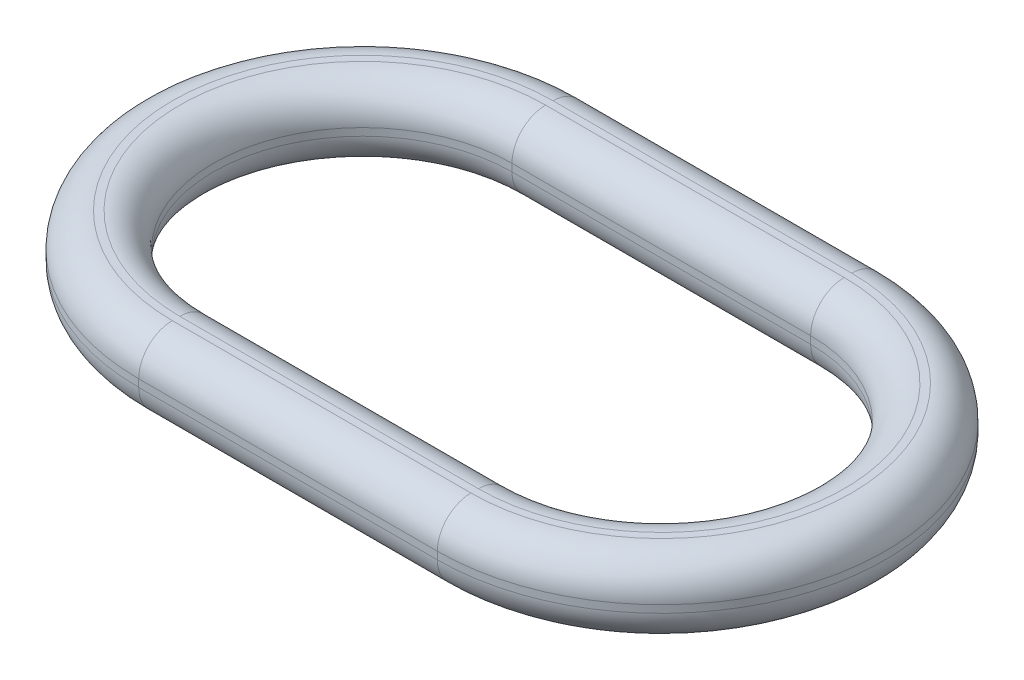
ISO-10303-21;
HEADER;
FILE_DESCRIPTION(('STEP AP214'),'2;1');
FILE_NAME('part.step','',(''),(''),'','','');
FILE_SCHEMA(('AUTOMOTIVE_DESIGN { 1 0 10303 214 1 1 1 1 }'));
ENDSEC;
DATA;
#1=APPLICATION_CONTEXT('core data for automotive mechanical design processes');
#2=APPLICATION_PROTOCOL_DEFINITION('international standard','automotive_design',2000,#1);
#3=PRODUCT_CONTEXT('',#1,'mechanical');
#4=PRODUCT('Part','Part','',(#3));
#5=PRODUCT_RELATED_PRODUCT_CATEGORY('part','',(#4));
#6=PRODUCT_DEFINITION_FORMATION('','',#4);
#7=PRODUCT_DEFINITION_CONTEXT('part definition',#1,'design');
#8=PRODUCT_DEFINITION('design','',#6,#7);
#9=PRODUCT_DEFINITION_SHAPE('','',#8);
#10=(LENGTH_UNIT() NAMED_UNIT(*) SI_UNIT(.MILLI.,.METRE.));
#11=(NAMED_UNIT(*) PLANE_ANGLE_UNIT() SI_UNIT($,.RADIAN.));
#12=(NAMED_UNIT(*) SI_UNIT($,.STERADIAN.) SOLID_ANGLE_UNIT());
#13=UNCERTAINTY_MEASURE_WITH_UNIT(LENGTH_MEASURE(1.E-05),#10,'distance_accuracy_value','');
#14=(GEOMETRIC_REPRESENTATION_CONTEXT(3) GLOBAL_UNCERTAINTY_ASSIGNED_CONTEXT((#13)) GLOBAL_UNIT_ASSIGNED_CONTEXT((#10,
#11,#12)) REPRESENTATION_CONTEXT('',''));
#15=CARTESIAN_POINT('',(0.,0.,0.));
#16=DIRECTION('',(0.,0.,1.));
#17=DIRECTION('',(1.,0.,0.));
#18=AXIS2_PLACEMENT_3D('',#15,#16,#17);
#19=CARTESIAN_POINT('',(0.,1.,0.));
#20=DIRECTION('',(0.,1.,0.));
#21=DIRECTION('',(0.,0.,1.));
#22=AXIS2_PLACEMENT_3D('',#19,#20,#21);
#23=PLANE('',#22);
#24=DIRECTION('',(-1.,0.,0.));
#25=VECTOR('',#24,1.);
#26=CARTESIAN_POINT('',(0.,1.,-2.55));
#27=LINE('',#26,#25);
#28=CARTESIAN_POINT('',(4.,1.,-2.55));
#29=VERTEX_POINT('',#28);
#30=CARTESIAN_POINT('',(0.,1.,-2.55));
#31=VERTEX_POINT('',#30);
#32=EDGE_CURVE('E50',#29,#31,#27,.T.);
#33=ORIENTED_EDGE('',*,*,#32,.T.);
#34=CARTESIAN_POINT('',(0.,1.,0.));
#35=DIRECTION('',(0.,1.,0.));
#36=DIRECTION('',(0.,0.,1.));
#37=AXIS2_PLACEMENT_3D('',#34,#35,#36);
#38=CIRCLE('',#37,2.55);
#39=CARTESIAN_POINT('',(0.,1.,2.55));
#40=VERTEX_POINT('',#39);
#41=EDGE_CURVE('E231',#31,#40,#38,.T.);
#42=ORIENTED_EDGE('',*,*,#41,.T.);
#43=DIRECTION('',(1.,0.,0.));
#44=VECTOR('',#43,1.);
#45=CARTESIAN_POINT('',(4.,1.,2.55));
#46=LINE('',#45,#44);
#47=CARTESIAN_POINT('',(4.,1.,2.55));
#48=VERTEX_POINT('',#47);
#49=EDGE_CURVE('E227',#40,#48,#46,.T.);
#50=ORIENTED_EDGE('',*,*,#49,.T.);
#51=CARTESIAN_POINT('',(4.,1.,0.));
#52=DIRECTION('',(0.,1.,0.));
#53=DIRECTION('',(0.,0.,1.));
#54=AXIS2_PLACEMENT_3D('',#51,#52,#53);
#55=CIRCLE('',#54,2.55);
#56=EDGE_CURVE('E55',#48,#29,#55,.T.);
#57=ORIENTED_EDGE('',*,*,#56,.T.);
#58=EDGE_LOOP('',(#33,#42,#50,#57));
#59=FACE_BOUND('',#58,.T.);
#60=DIRECTION('',(-1.,0.,0.));
#61=VECTOR('',#60,1.);
#62=CARTESIAN_POINT('',(0.,1.,-2.45));
#63=LINE('',#62,#61);
#64=CARTESIAN_POINT('',(0.,1.,-2.45));
#65=VERTEX_POINT('',#64);
#66=CARTESIAN_POINT('',(4.,1.,-2.45));
#67=VERTEX_POINT('',#66);
#68=EDGE_CURVE('E218',#65,#67,#63,.F.);
#69=ORIENTED_EDGE('',*,*,#68,.T.);
#70=CARTESIAN_POINT('',(4.,1.,0.));
#71=DIRECTION('',(0.,1.,0.));
#72=DIRECTION('',(0.,0.,1.));
#73=AXIS2_PLACEMENT_3D('',#70,#71,#72);
#74=CIRCLE('',#73,2.45);
#75=CARTESIAN_POINT('',(4.,1.,2.45));
#76=VERTEX_POINT('',#75);
#77=EDGE_CURVE('E224',#67,#76,#74,.F.);
#78=ORIENTED_EDGE('',*,*,#77,.T.);
#79=DIRECTION('',(1.,0.,0.));
#80=VECTOR('',#79,1.);
#81=CARTESIAN_POINT('',(0.,1.,2.45));
#82=LINE('',#81,#80);
#83=CARTESIAN_POINT('',(0.,1.,2.45));
#84=VERTEX_POINT('',#83);
#85=EDGE_CURVE('E222',#76,#84,#82,.F.);
#86=ORIENTED_EDGE('',*,*,#85,.T.);
#87=CARTESIAN_POINT('',(0.,1.,0.));
#88=DIRECTION('',(0.,1.,0.));
#89=DIRECTION('',(0.,0.,1.));
#90=AXIS2_PLACEMENT_3D('',#87,#88,#89);
#91=CIRCLE('',#90,2.45);
#92=EDGE_CURVE('E220',#84,#65,#91,.F.);
#93=ORIENTED_EDGE('',*,*,#92,.T.);
#94=EDGE_LOOP('',(#69,#78,#86,#93));
#95=FACE_BOUND('',#94,.T.);
#96=ADVANCED_FACE('F33',(#59,#95),#23,.T.);
#97=CARTESIAN_POINT('',(0.,0.,0.));
#98=DIRECTION('',(0.,1.,0.));
#99=DIRECTION('',(0.,0.,1.));
#100=AXIS2_PLACEMENT_3D('',#97,#98,#99);
#101=PLANE('',#100);
#102=DIRECTION('',(-1.,0.,0.));
#103=VECTOR('',#102,1.);
#104=CARTESIAN_POINT('',(0.,0.,-2.45));
#105=LINE('',#104,#103);
#106=CARTESIAN_POINT('',(4.,0.,-2.45));
#107=VERTEX_POINT('',#106);
#108=CARTESIAN_POINT('',(0.,0.,-2.45));
#109=VERTEX_POINT('',#108);
#110=EDGE_CURVE('E186',#107,#109,#105,.T.);
#111=ORIENTED_EDGE('',*,*,#110,.T.);
#112=CARTESIAN_POINT('',(0.,0.,0.));
#113=DIRECTION('',(0.,1.,0.));
#114=DIRECTION('',(0.,0.,1.));
#115=AXIS2_PLACEMENT_3D('',#112,#113,#114);
#116=CIRCLE('',#115,2.45);
#117=CARTESIAN_POINT('',(0.,0.,2.45));
#118=VERTEX_POINT('',#117);
#119=EDGE_CURVE('E188',#109,#118,#116,.T.);
#120=ORIENTED_EDGE('',*,*,#119,.T.);
#121=DIRECTION('',(1.,0.,0.));
#122=VECTOR('',#121,1.);
#123=CARTESIAN_POINT('',(4.,0.,2.45));
#124=LINE('',#123,#122);
#125=CARTESIAN_POINT('',(4.,0.,2.45));
#126=VERTEX_POINT('',#125);
#127=EDGE_CURVE('E182',#118,#126,#124,.T.);
#128=ORIENTED_EDGE('',*,*,#127,.T.);
#129=CARTESIAN_POINT('',(4.,0.,0.));
#130=DIRECTION('',(0.,1.,0.));
#131=DIRECTION('',(0.,0.,1.));
#132=AXIS2_PLACEMENT_3D('',#129,#130,#131);
#133=CIRCLE('',#132,2.45);
#134=EDGE_CURVE('E184',#126,#107,#133,.T.);
#135=ORIENTED_EDGE('',*,*,#134,.T.);
#136=EDGE_LOOP('',(#111,#120,#128,#135));
#137=FACE_BOUND('',#136,.T.);
#138=DIRECTION('',(1.,0.,0.));
#139=VECTOR('',#138,1.);
#140=CARTESIAN_POINT('',(0.,0.,2.55));
#141=LINE('',#140,#139);
#142=CARTESIAN_POINT('',(4.,0.,2.55));
#143=VERTEX_POINT('',#142);
#144=CARTESIAN_POINT('',(0.,0.,2.55));
#145=VERTEX_POINT('',#144);
#146=EDGE_CURVE('E151',#143,#145,#141,.F.);
#147=ORIENTED_EDGE('',*,*,#146,.T.);
#148=CARTESIAN_POINT('',(0.,0.,0.));
#149=DIRECTION('',(0.,1.,0.));
#150=DIRECTION('',(0.,0.,1.));
#151=AXIS2_PLACEMENT_3D('',#148,#149,#150);
#152=CIRCLE('',#151,2.55);
#153=CARTESIAN_POINT('',(0.,0.,-2.55));
#154=VERTEX_POINT('',#153);
#155=EDGE_CURVE('E180',#145,#154,#152,.F.);
#156=ORIENTED_EDGE('',*,*,#155,.T.);
#157=DIRECTION('',(-1.,0.,0.));
#158=VECTOR('',#157,1.);
#159=CARTESIAN_POINT('',(0.,0.,-2.55));
#160=LINE('',#159,#158);
#161=CARTESIAN_POINT('',(4.,0.,-2.55));
#162=VERTEX_POINT('',#161);
#163=EDGE_CURVE('E154',#154,#162,#160,.F.);
#164=ORIENTED_EDGE('',*,*,#163,.T.);
#165=CARTESIAN_POINT('',(4.,0.,0.));
#166=DIRECTION('',(0.,1.,0.));
#167=DIRECTION('',(0.,0.,1.));
#168=AXIS2_PLACEMENT_3D('',#165,#166,#167);
#169=CIRCLE('',#168,2.55);
#170=EDGE_CURVE('E146',#162,#143,#169,.F.);
#171=ORIENTED_EDGE('',*,*,#170,.T.);
#172=EDGE_LOOP('',(#147,#156,#164,#171));
#173=FACE_BOUND('',#172,.T.);
#174=ADVANCED_FACE('F148',(#137,#173),#101,.F.);
#175=CARTESIAN_POINT('',(0.,1.,0.));
#176=DIRECTION('',(0.,-1.,0.));
#177=DIRECTION('',(0.,0.,-1.));
#178=AXIS2_PLACEMENT_3D('',#175,#176,#177);
#179=CYLINDRICAL_SURFACE('',#178,3.);
#180=DIRECTION('',(0.,-1.,0.));
#181=VECTOR('',#180,1.);
#182=CARTESIAN_POINT('',(0.,1.,-3.));
#183=LINE('',#182,#181);
#184=CARTESIAN_POINT('',(0.,0.55,-3.));
#185=VERTEX_POINT('',#184);
#186=CARTESIAN_POINT('',(0.,0.45,-3.));
#187=VERTEX_POINT('',#186);
#188=EDGE_CURVE('E309',#185,#187,#183,.T.);
#189=ORIENTED_EDGE('',*,*,#188,.T.);
#190=CARTESIAN_POINT('',(0.,0.45,0.));
#191=DIRECTION('',(0.,1.,0.));
#192=DIRECTION('',(0.,0.,1.));
#193=AXIS2_PLACEMENT_3D('',#190,#191,#192);
#194=CIRCLE('',#193,3.);
#195=CARTESIAN_POINT('',(0.,0.45,3.));
#196=VERTEX_POINT('',#195);
#197=EDGE_CURVE('E208',#187,#196,#194,.T.);
#198=ORIENTED_EDGE('',*,*,#197,.T.);
#199=DIRECTION('',(0.,-1.,0.));
#200=VECTOR('',#199,1.);
#201=CARTESIAN_POINT('',(0.,1.,3.));
#202=LINE('',#201,#200);
#203=CARTESIAN_POINT('',(0.,0.55,3.));
#204=VERTEX_POINT('',#203);
#205=EDGE_CURVE('E172',#204,#196,#202,.T.);
#206=ORIENTED_EDGE('',*,*,#205,.F.);
#207=CARTESIAN_POINT('',(0.,0.55,0.));
#208=DIRECTION('',(0.,1.,0.));
#209=DIRECTION('',(0.,0.,1.));
#210=AXIS2_PLACEMENT_3D('',#207,#208,#209);
#211=CIRCLE('',#210,3.);
#212=EDGE_CURVE('E205',#204,#185,#211,.F.);
#213=ORIENTED_EDGE('',*,*,#212,.T.);
#214=EDGE_LOOP('',(#189,#198,#206,#213));
#215=FACE_BOUND('',#214,.T.);
#216=ADVANCED_FACE('F338',(#215),#179,.T.);
#217=CARTESIAN_POINT('',(0.,1.,3.));
#218=DIRECTION('',(0.,0.,-1.));
#219=DIRECTION('',(-1.,0.,0.));
#220=AXIS2_PLACEMENT_3D('',#217,#218,#219);
#221=PLANE('',#220);
#222=ORIENTED_EDGE('',*,*,#205,.T.);
#223=DIRECTION('',(1.,0.,0.));
#224=VECTOR('',#223,1.);
#225=CARTESIAN_POINT('',(0.,0.45,3.));
#226=LINE('',#225,#224);
#227=CARTESIAN_POINT('',(4.,0.45,3.));
#228=VERTEX_POINT('',#227);
#229=EDGE_CURVE('E11',#196,#228,#226,.T.);
#230=ORIENTED_EDGE('',*,*,#229,.T.);
#231=DIRECTION('',(0.,-1.,0.));
#232=VECTOR('',#231,1.);
#233=CARTESIAN_POINT('',(4.,1.,3.));
#234=LINE('',#233,#232);
#235=CARTESIAN_POINT('',(4.,0.55,3.));
#236=VERTEX_POINT('',#235);
#237=EDGE_CURVE('E175',#236,#228,#234,.T.);
#238=ORIENTED_EDGE('',*,*,#237,.F.);
#239=DIRECTION('',(1.,0.,0.));
#240=VECTOR('',#239,1.);
#241=CARTESIAN_POINT('',(0.,0.55,3.));
#242=LINE('',#241,#240);
#243=EDGE_CURVE('E42',#236,#204,#242,.F.);
#244=ORIENTED_EDGE('',*,*,#243,.T.);
#245=EDGE_LOOP('',(#222,#230,#238,#244));
#246=FACE_BOUND('',#245,.T.);
#247=ADVANCED_FACE('F322',(#246),#221,.F.);
#248=CARTESIAN_POINT('',(4.,1.,0.));
#249=DIRECTION('',(0.,-1.,0.));
#250=DIRECTION('',(0.,0.,-1.));
#251=AXIS2_PLACEMENT_3D('',#248,#249,#250);
#252=CYLINDRICAL_SURFACE('',#251,3.);
#253=ORIENTED_EDGE('',*,*,#237,.T.);
#254=CARTESIAN_POINT('',(4.,0.45,0.));
#255=DIRECTION('',(0.,1.,0.));
#256=DIRECTION('',(0.,0.,1.));
#257=AXIS2_PLACEMENT_3D('',#254,#255,#256);
#258=CIRCLE('',#257,3.);
#259=CARTESIAN_POINT('',(4.,0.45,-3.));
#260=VERTEX_POINT('',#259);
#261=EDGE_CURVE('E163',#228,#260,#258,.T.);
#262=ORIENTED_EDGE('',*,*,#261,.T.);
#263=DIRECTION('',(0.,-1.,0.));
#264=VECTOR('',#263,1.);
#265=CARTESIAN_POINT('',(4.,1.,-3.));
#266=LINE('',#265,#264);
#267=CARTESIAN_POINT('',(4.,0.55,-3.));
#268=VERTEX_POINT('',#267);
#269=EDGE_CURVE('E312',#268,#260,#266,.T.);
#270=ORIENTED_EDGE('',*,*,#269,.F.);
#271=CARTESIAN_POINT('',(4.,0.55,0.));
#272=DIRECTION('',(0.,1.,0.));
#273=DIRECTION('',(0.,0.,1.));
#274=AXIS2_PLACEMENT_3D('',#271,#272,#273);
#275=CIRCLE('',#274,3.);
#276=EDGE_CURVE('E215',#268,#236,#275,.F.);
#277=ORIENTED_EDGE('',*,*,#276,.T.);
#278=EDGE_LOOP('',(#253,#262,#270,#277));
#279=FACE_BOUND('',#278,.T.);
#280=ADVANCED_FACE('F317',(#279),#252,.T.);
#281=CARTESIAN_POINT('',(0.,1.,-3.));
#282=DIRECTION('',(0.,0.,1.));
#283=DIRECTION('',(1.,0.,0.));
#284=AXIS2_PLACEMENT_3D('',#281,#282,#283);
#285=PLANE('',#284);
#286=ORIENTED_EDGE('',*,*,#269,.T.);
#287=DIRECTION('',(-1.,0.,0.));
#288=VECTOR('',#287,1.);
#289=CARTESIAN_POINT('',(0.,0.45,-3.));
#290=LINE('',#289,#288);
#291=EDGE_CURVE('E213',#260,#187,#290,.T.);
#292=ORIENTED_EDGE('',*,*,#291,.T.);
#293=ORIENTED_EDGE('',*,*,#188,.F.);
#294=DIRECTION('',(-1.,0.,0.));
#295=VECTOR('',#294,1.);
#296=CARTESIAN_POINT('',(4.,0.55,-3.));
#297=LINE('',#296,#295);
#298=EDGE_CURVE('E211',#185,#268,#297,.F.);
#299=ORIENTED_EDGE('',*,*,#298,.T.);
#300=EDGE_LOOP('',(#286,#292,#293,#299));
#301=FACE_BOUND('',#300,.T.);
#302=ADVANCED_FACE('F341',(#301),#285,.F.);
#303=CARTESIAN_POINT('',(0.,1.,0.));
#304=DIRECTION('',(0.,-1.,0.));
#305=DIRECTION('',(0.,0.,-1.));
#306=AXIS2_PLACEMENT_3D('',#303,#304,#305);
#307=CYLINDRICAL_SURFACE('',#306,2.);
#308=DIRECTION('',(0.,-1.,0.));
#309=VECTOR('',#308,1.);
#310=CARTESIAN_POINT('',(0.,1.,2.));
#311=LINE('',#310,#309);
#312=CARTESIAN_POINT('',(0.,0.55,2.));
#313=VERTEX_POINT('',#312);
#314=CARTESIAN_POINT('',(0.,0.45,2.));
#315=VERTEX_POINT('',#314);
#316=EDGE_CURVE('E303',#313,#315,#311,.T.);
#317=ORIENTED_EDGE('',*,*,#316,.T.);
#318=CARTESIAN_POINT('',(0.,0.45,0.));
#319=DIRECTION('',(0.,1.,0.));
#320=DIRECTION('',(0.,0.,1.));
#321=AXIS2_PLACEMENT_3D('',#318,#319,#320);
#322=CIRCLE('',#321,2.);
#323=CARTESIAN_POINT('',(0.,0.45,-2.));
#324=VERTEX_POINT('',#323);
#325=EDGE_CURVE('E193',#315,#324,#322,.F.);
#326=ORIENTED_EDGE('',*,*,#325,.T.);
#327=DIRECTION('',(0.,-1.,0.));
#328=VECTOR('',#327,1.);
#329=CARTESIAN_POINT('',(0.,1.,-2.));
#330=LINE('',#329,#328);
#331=CARTESIAN_POINT('',(0.,0.55,-2.));
#332=VERTEX_POINT('',#331);
#333=EDGE_CURVE('E248',#332,#324,#330,.T.);
#334=ORIENTED_EDGE('',*,*,#333,.F.);
#335=CARTESIAN_POINT('',(0.,0.55,0.));
#336=DIRECTION('',(0.,1.,0.));
#337=DIRECTION('',(0.,0.,1.));
#338=AXIS2_PLACEMENT_3D('',#335,#336,#337);
#339=CIRCLE('',#338,2.);
#340=EDGE_CURVE('E191',#332,#313,#339,.T.);
#341=ORIENTED_EDGE('',*,*,#340,.T.);
#342=EDGE_LOOP('',(#317,#326,#334,#341));
#343=FACE_BOUND('',#342,.T.);
#344=ADVANCED_FACE('F366',(#343),#307,.F.);
#345=CARTESIAN_POINT('',(0.,1.,2.));
#346=DIRECTION('',(0.,0.,-1.));
#347=DIRECTION('',(-1.,0.,0.));
#348=AXIS2_PLACEMENT_3D('',#345,#346,#347);
#349=PLANE('',#348);
#350=ORIENTED_EDGE('',*,*,#316,.F.);
#351=DIRECTION('',(1.,0.,0.));
#352=VECTOR('',#351,1.);
#353=CARTESIAN_POINT('',(0.,0.55,2.));
#354=LINE('',#353,#352);
#355=CARTESIAN_POINT('',(4.,0.55,2.));
#356=VERTEX_POINT('',#355);
#357=EDGE_CURVE('E235',#313,#356,#354,.T.);
#358=ORIENTED_EDGE('',*,*,#357,.T.);
#359=DIRECTION('',(0.,-1.,0.));
#360=VECTOR('',#359,1.);
#361=CARTESIAN_POINT('',(4.,1.,2.));
#362=LINE('',#361,#360);
#363=CARTESIAN_POINT('',(4.,0.45,2.));
#364=VERTEX_POINT('',#363);
#365=EDGE_CURVE('E299',#356,#364,#362,.T.);
#366=ORIENTED_EDGE('',*,*,#365,.T.);
#367=DIRECTION('',(1.,0.,0.));
#368=VECTOR('',#367,1.);
#369=CARTESIAN_POINT('',(0.,0.45,2.));
#370=LINE('',#369,#368);
#371=EDGE_CURVE('E233',#364,#315,#370,.F.);
#372=ORIENTED_EDGE('',*,*,#371,.T.);
#373=EDGE_LOOP('',(#350,#358,#366,#372));
#374=FACE_BOUND('',#373,.T.);
#375=ADVANCED_FACE('F403',(#374),#349,.T.);
#376=CARTESIAN_POINT('',(4.,1.,0.));
#377=DIRECTION('',(0.,-1.,0.));
#378=DIRECTION('',(0.,0.,-1.));
#379=AXIS2_PLACEMENT_3D('',#376,#377,#378);
#380=CYLINDRICAL_SURFACE('',#379,2.);
#381=DIRECTION('',(0.,-1.,0.));
#382=VECTOR('',#381,1.);
#383=CARTESIAN_POINT('',(4.,1.,-2.));
#384=LINE('',#383,#382);
#385=CARTESIAN_POINT('',(4.,0.55,-2.));
#386=VERTEX_POINT('',#385);
#387=CARTESIAN_POINT('',(4.,0.45,-2.));
#388=VERTEX_POINT('',#387);
#389=EDGE_CURVE('E296',#386,#388,#384,.T.);
#390=ORIENTED_EDGE('',*,*,#389,.T.);
#391=CARTESIAN_POINT('',(4.,0.45,0.));
#392=DIRECTION('',(0.,1.,0.));
#393=DIRECTION('',(0.,0.,1.));
#394=AXIS2_PLACEMENT_3D('',#391,#392,#393);
#395=CIRCLE('',#394,2.);
#396=EDGE_CURVE('E203',#388,#364,#395,.F.);
#397=ORIENTED_EDGE('',*,*,#396,.T.);
#398=ORIENTED_EDGE('',*,*,#365,.F.);
#399=CARTESIAN_POINT('',(4.,0.55,0.));
#400=DIRECTION('',(0.,1.,0.));
#401=DIRECTION('',(0.,0.,1.));
#402=AXIS2_PLACEMENT_3D('',#399,#400,#401);
#403=CIRCLE('',#402,2.);
#404=EDGE_CURVE('E200',#356,#386,#403,.T.);
#405=ORIENTED_EDGE('',*,*,#404,.T.);
#406=EDGE_LOOP('',(#390,#397,#398,#405));
#407=FACE_BOUND('',#406,.T.);
#408=ADVANCED_FACE('F295',(#407),#380,.F.);
#409=CARTESIAN_POINT('',(0.,1.,-2.));
#410=DIRECTION('',(0.,0.,1.));
#411=DIRECTION('',(1.,0.,0.));
#412=AXIS2_PLACEMENT_3D('',#409,#410,#411);
#413=PLANE('',#412);
#414=ORIENTED_EDGE('',*,*,#333,.T.);
#415=DIRECTION('',(-1.,0.,0.));
#416=VECTOR('',#415,1.);
#417=CARTESIAN_POINT('',(4.,0.45,-2.));
#418=LINE('',#417,#416);
#419=EDGE_CURVE('E198',#324,#388,#418,.F.);
#420=ORIENTED_EDGE('',*,*,#419,.T.);
#421=ORIENTED_EDGE('',*,*,#389,.F.);
#422=DIRECTION('',(-1.,0.,0.));
#423=VECTOR('',#422,1.);
#424=CARTESIAN_POINT('',(0.,0.55,-2.));
#425=LINE('',#424,#423);
#426=EDGE_CURVE('E196',#386,#332,#425,.T.);
#427=ORIENTED_EDGE('',*,*,#426,.T.);
#428=EDGE_LOOP('',(#414,#420,#421,#427));
#429=FACE_BOUND('',#428,.T.);
#430=ADVANCED_FACE('F300',(#429),#413,.T.);
#431=CARTESIAN_POINT('',(4.,0.45,0.));
#432=DIRECTION('',(0.,1.,0.));
#433=DIRECTION('',(0.,0.,1.));
#434=AXIS2_PLACEMENT_3D('',#431,#432,#433);
#435=TOROIDAL_SURFACE('',#434,2.45,0.45);
#436=CARTESIAN_POINT('',(4.,0.45,2.45));
#437=DIRECTION('',(-1.,0.,0.));
#438=DIRECTION('',(0.,0.,1.));
#439=AXIS2_PLACEMENT_3D('',#436,#437,#438);
#440=CIRCLE('',#439,0.45);
#441=EDGE_CURVE('E242',#364,#126,#440,.T.);
#442=ORIENTED_EDGE('',*,*,#441,.F.);
#443=ORIENTED_EDGE('',*,*,#396,.F.);
#444=CARTESIAN_POINT('',(4.,0.45,-2.45));
#445=DIRECTION('',(-1.,0.,0.));
#446=DIRECTION('',(0.,0.,1.));
#447=AXIS2_PLACEMENT_3D('',#444,#445,#446);
#448=CIRCLE('',#447,0.45);
#449=EDGE_CURVE('E245',#107,#388,#448,.T.);
#450=ORIENTED_EDGE('',*,*,#449,.F.);
#451=ORIENTED_EDGE('',*,*,#134,.F.);
#452=EDGE_LOOP('',(#442,#443,#450,#451));
#453=FACE_BOUND('',#452,.T.);
#454=ADVANCED_FACE('F387',(#453),#435,.T.);
#455=CARTESIAN_POINT('',(0.,0.45,-2.45));
#456=DIRECTION('',(1.,0.,0.));
#457=DIRECTION('',(0.,0.,-1.));
#458=AXIS2_PLACEMENT_3D('',#455,#456,#457);
#459=CYLINDRICAL_SURFACE('',#458,0.45);
#460=ORIENTED_EDGE('',*,*,#449,.T.);
#461=ORIENTED_EDGE('',*,*,#419,.F.);
#462=CARTESIAN_POINT('',(0.,0.45,-2.45));
#463=DIRECTION('',(-1.,0.,0.));
#464=DIRECTION('',(0.,0.,1.));
#465=AXIS2_PLACEMENT_3D('',#462,#463,#464);
#466=CIRCLE('',#465,0.45);
#467=EDGE_CURVE('E240',#109,#324,#466,.T.);
#468=ORIENTED_EDGE('',*,*,#467,.F.);
#469=ORIENTED_EDGE('',*,*,#110,.F.);
#470=EDGE_LOOP('',(#460,#461,#468,#469));
#471=FACE_BOUND('',#470,.T.);
#472=ADVANCED_FACE('F384',(#471),#459,.T.);
#473=CARTESIAN_POINT('',(0.,0.45,2.45));
#474=DIRECTION('',(-1.,0.,0.));
#475=DIRECTION('',(0.,0.,1.));
#476=AXIS2_PLACEMENT_3D('',#473,#474,#475);
#477=CYLINDRICAL_SURFACE('',#476,0.45);
#478=ORIENTED_EDGE('',*,*,#441,.T.);
#479=ORIENTED_EDGE('',*,*,#127,.F.);
#480=CARTESIAN_POINT('',(0.,0.45,2.45));
#481=DIRECTION('',(-1.,0.,0.));
#482=DIRECTION('',(0.,-1.,0.));
#483=AXIS2_PLACEMENT_3D('',#480,#481,#482);
#484=CIRCLE('',#483,0.45);
#485=EDGE_CURVE('E238',#315,#118,#484,.T.);
#486=ORIENTED_EDGE('',*,*,#485,.F.);
#487=ORIENTED_EDGE('',*,*,#371,.F.);
#488=EDGE_LOOP('',(#478,#479,#486,#487));
#489=FACE_BOUND('',#488,.T.);
#490=ADVANCED_FACE('F380',(#489),#477,.T.);
#491=CARTESIAN_POINT('',(0.,0.45,0.));
#492=DIRECTION('',(0.,1.,0.));
#493=DIRECTION('',(0.,0.,1.));
#494=AXIS2_PLACEMENT_3D('',#491,#492,#493);
#495=TOROIDAL_SURFACE('',#494,2.45,0.45);
#496=ORIENTED_EDGE('',*,*,#467,.T.);
#497=ORIENTED_EDGE('',*,*,#325,.F.);
#498=ORIENTED_EDGE('',*,*,#485,.T.);
#499=ORIENTED_EDGE('',*,*,#119,.F.);
#500=EDGE_LOOP('',(#496,#497,#498,#499));
#501=FACE_BOUND('',#500,.T.);
#502=ADVANCED_FACE('F377',(#501),#495,.T.);
#503=CARTESIAN_POINT('',(4.,0.45,0.));
#504=DIRECTION('',(0.,1.,0.));
#505=DIRECTION('',(0.,0.,1.));
#506=AXIS2_PLACEMENT_3D('',#503,#504,#505);
#507=TOROIDAL_SURFACE('',#506,2.55,0.45);
#508=CARTESIAN_POINT('',(4.,0.45,2.55));
#509=DIRECTION('',(-1.,0.,0.));
#510=DIRECTION('',(0.,0.,1.));
#511=AXIS2_PLACEMENT_3D('',#508,#509,#510);
#512=CIRCLE('',#511,0.45);
#513=EDGE_CURVE('E161',#143,#228,#512,.T.);
#514=ORIENTED_EDGE('',*,*,#513,.F.);
#515=ORIENTED_EDGE('',*,*,#170,.F.);
#516=CARTESIAN_POINT('',(4.,0.45,-2.55));
#517=DIRECTION('',(-1.,0.,0.));
#518=DIRECTION('',(0.,0.,1.));
#519=AXIS2_PLACEMENT_3D('',#516,#517,#518);
#520=CIRCLE('',#519,0.45);
#521=EDGE_CURVE('E166',#260,#162,#520,.T.);
#522=ORIENTED_EDGE('',*,*,#521,.F.);
#523=ORIENTED_EDGE('',*,*,#261,.F.);
#524=EDGE_LOOP('',(#514,#515,#522,#523));
#525=FACE_BOUND('',#524,.T.);
#526=ADVANCED_FACE('F162',(#525),#507,.T.);
#527=CARTESIAN_POINT('',(0.,0.45,-2.55));
#528=DIRECTION('',(-1.,0.,0.));
#529=DIRECTION('',(0.,0.,1.));
#530=AXIS2_PLACEMENT_3D('',#527,#528,#529);
#531=CYLINDRICAL_SURFACE('',#530,0.45);
#532=ORIENTED_EDGE('',*,*,#521,.T.);
#533=ORIENTED_EDGE('',*,*,#163,.F.);
#534=CARTESIAN_POINT('',(0.,0.45,-2.55));
#535=DIRECTION('',(-1.,0.,0.));
#536=DIRECTION('',(0.,-1.,0.));
#537=AXIS2_PLACEMENT_3D('',#534,#535,#536);
#538=CIRCLE('',#537,0.45);
#539=EDGE_CURVE('E167',#187,#154,#538,.T.);
#540=ORIENTED_EDGE('',*,*,#539,.F.);
#541=ORIENTED_EDGE('',*,*,#291,.F.);
#542=EDGE_LOOP('',(#532,#533,#540,#541));
#543=FACE_BOUND('',#542,.T.);
#544=ADVANCED_FACE('F344',(#543),#531,.T.);
#545=CARTESIAN_POINT('',(0.,0.45,2.55));
#546=DIRECTION('',(1.,0.,0.));
#547=DIRECTION('',(0.,0.,-1.));
#548=AXIS2_PLACEMENT_3D('',#545,#546,#547);
#549=CYLINDRICAL_SURFACE('',#548,0.45);
#550=ORIENTED_EDGE('',*,*,#513,.T.);
#551=ORIENTED_EDGE('',*,*,#229,.F.);
#552=CARTESIAN_POINT('',(0.,0.45,2.55));
#553=DIRECTION('',(-1.,0.,0.));
#554=DIRECTION('',(0.,0.,1.));
#555=AXIS2_PLACEMENT_3D('',#552,#553,#554);
#556=CIRCLE('',#555,0.45);
#557=EDGE_CURVE('E171',#145,#196,#556,.T.);
#558=ORIENTED_EDGE('',*,*,#557,.F.);
#559=ORIENTED_EDGE('',*,*,#146,.F.);
#560=EDGE_LOOP('',(#550,#551,#558,#559));
#561=FACE_BOUND('',#560,.T.);
#562=ADVANCED_FACE('F170',(#561),#549,.T.);
#563=CARTESIAN_POINT('',(0.,0.45,0.));
#564=DIRECTION('',(0.,1.,0.));
#565=DIRECTION('',(0.,0.,1.));
#566=AXIS2_PLACEMENT_3D('',#563,#564,#565);
#567=TOROIDAL_SURFACE('',#566,2.55,0.45);
#568=ORIENTED_EDGE('',*,*,#539,.T.);
#569=ORIENTED_EDGE('',*,*,#155,.F.);
#570=ORIENTED_EDGE('',*,*,#557,.T.);
#571=ORIENTED_EDGE('',*,*,#197,.F.);
#572=EDGE_LOOP('',(#568,#569,#570,#571));
#573=FACE_BOUND('',#572,.T.);
#574=ADVANCED_FACE('F347',(#573),#567,.T.);
#575=CARTESIAN_POINT('',(4.,0.55,0.));
#576=DIRECTION('',(0.,1.,0.));
#577=DIRECTION('',(0.,0.,1.));
#578=AXIS2_PLACEMENT_3D('',#575,#576,#577);
#579=TOROIDAL_SURFACE('',#578,2.55,0.45);
#580=CARTESIAN_POINT('',(4.,0.55,2.55));
#581=DIRECTION('',(-1.,0.,0.));
#582=DIRECTION('',(0.,0.,1.));
#583=AXIS2_PLACEMENT_3D('',#580,#581,#582);
#584=CIRCLE('',#583,0.45);
#585=EDGE_CURVE('E257',#236,#48,#584,.T.);
#586=ORIENTED_EDGE('',*,*,#585,.F.);
#587=ORIENTED_EDGE('',*,*,#276,.F.);
#588=CARTESIAN_POINT('',(4.,0.55,-2.55));
#589=DIRECTION('',(-1.,0.,0.));
#590=DIRECTION('',(0.,0.,1.));
#591=AXIS2_PLACEMENT_3D('',#588,#589,#590);
#592=CIRCLE('',#591,0.45);
#593=EDGE_CURVE('E250',#29,#268,#592,.T.);
#594=ORIENTED_EDGE('',*,*,#593,.F.);
#595=ORIENTED_EDGE('',*,*,#56,.F.);
#596=EDGE_LOOP('',(#586,#587,#594,#595));
#597=FACE_BOUND('',#596,.T.);
#598=ADVANCED_FACE('F326',(#597),#579,.T.);
#599=CARTESIAN_POINT('',(0.,0.55,-2.55));
#600=DIRECTION('',(1.,0.,0.));
#601=DIRECTION('',(0.,0.,-1.));
#602=AXIS2_PLACEMENT_3D('',#599,#600,#601);
#603=CYLINDRICAL_SURFACE('',#602,0.45);
#604=ORIENTED_EDGE('',*,*,#593,.T.);
#605=ORIENTED_EDGE('',*,*,#298,.F.);
#606=CARTESIAN_POINT('',(0.,0.55,-2.55));
#607=DIRECTION('',(-1.,0.,0.));
#608=DIRECTION('',(0.,0.,1.));
#609=AXIS2_PLACEMENT_3D('',#606,#607,#608);
#610=CIRCLE('',#609,0.45);
#611=EDGE_CURVE('E255',#31,#185,#610,.T.);
#612=ORIENTED_EDGE('',*,*,#611,.F.);
#613=ORIENTED_EDGE('',*,*,#32,.F.);
#614=EDGE_LOOP('',(#604,#605,#612,#613));
#615=FACE_BOUND('',#614,.T.);
#616=ADVANCED_FACE('F354',(#615),#603,.T.);
#617=CARTESIAN_POINT('',(0.,0.55,2.55));
#618=DIRECTION('',(-1.,0.,0.));
#619=DIRECTION('',(0.,0.,1.));
#620=AXIS2_PLACEMENT_3D('',#617,#618,#619);
#621=CYLINDRICAL_SURFACE('',#620,0.45);
#622=ORIENTED_EDGE('',*,*,#585,.T.);
#623=ORIENTED_EDGE('',*,*,#49,.F.);
#624=CARTESIAN_POINT('',(0.,0.55,2.55));
#625=DIRECTION('',(-1.,0.,0.));
#626=DIRECTION('',(0.,-1.,0.));
#627=AXIS2_PLACEMENT_3D('',#624,#625,#626);
#628=CIRCLE('',#627,0.45);
#629=EDGE_CURVE('E253',#204,#40,#628,.T.);
#630=ORIENTED_EDGE('',*,*,#629,.F.);
#631=ORIENTED_EDGE('',*,*,#243,.F.);
#632=EDGE_LOOP('',(#622,#623,#630,#631));
#633=FACE_BOUND('',#632,.T.);
#634=ADVANCED_FACE('F330',(#633),#621,.T.);
#635=CARTESIAN_POINT('',(0.,0.55,0.));
#636=DIRECTION('',(0.,1.,0.));
#637=DIRECTION('',(0.,0.,1.));
#638=AXIS2_PLACEMENT_3D('',#635,#636,#637);
#639=TOROIDAL_SURFACE('',#638,2.55,0.45);
#640=ORIENTED_EDGE('',*,*,#611,.T.);
#641=ORIENTED_EDGE('',*,*,#212,.F.);
#642=ORIENTED_EDGE('',*,*,#629,.T.);
#643=ORIENTED_EDGE('',*,*,#41,.F.);
#644=EDGE_LOOP('',(#640,#641,#642,#643));
#645=FACE_BOUND('',#644,.T.);
#646=ADVANCED_FACE('F334',(#645),#639,.T.);
#647=CARTESIAN_POINT('',(0.,0.55,0.));
#648=DIRECTION('',(0.,1.,0.));
#649=DIRECTION('',(0.,0.,1.));
#650=AXIS2_PLACEMENT_3D('',#647,#648,#649);
#651=TOROIDAL_SURFACE('',#650,2.45,0.45);
#652=CARTESIAN_POINT('',(0.,0.55,-2.45));
#653=DIRECTION('',(1.,0.,0.));
#654=DIRECTION('',(0.,0.,-1.));
#655=AXIS2_PLACEMENT_3D('',#652,#653,#654);
#656=CIRCLE('',#655,0.45);
#657=EDGE_CURVE('E265',#65,#332,#656,.T.);
#658=ORIENTED_EDGE('',*,*,#657,.F.);
#659=ORIENTED_EDGE('',*,*,#92,.F.);
#660=CARTESIAN_POINT('',(0.,0.55,2.45));
#661=DIRECTION('',(1.,0.,0.));
#662=DIRECTION('',(0.,0.,-1.));
#663=AXIS2_PLACEMENT_3D('',#660,#661,#662);
#664=CIRCLE('',#663,0.45);
#665=EDGE_CURVE('E37',#313,#84,#664,.T.);
#666=ORIENTED_EDGE('',*,*,#665,.F.);
#667=ORIENTED_EDGE('',*,*,#340,.F.);
#668=EDGE_LOOP('',(#658,#659,#666,#667));
#669=FACE_BOUND('',#668,.T.);
#670=ADVANCED_FACE('F35',(#669),#651,.T.);
#671=CARTESIAN_POINT('',(0.,0.55,2.45));
#672=DIRECTION('',(1.,0.,0.));
#673=DIRECTION('',(0.,0.,-1.));
#674=AXIS2_PLACEMENT_3D('',#671,#672,#673);
#675=CYLINDRICAL_SURFACE('',#674,0.45);
#676=ORIENTED_EDGE('',*,*,#665,.T.);
#677=ORIENTED_EDGE('',*,*,#85,.F.);
#678=CARTESIAN_POINT('',(4.,0.55,2.45));
#679=DIRECTION('',(1.,0.,0.));
#680=DIRECTION('',(0.,0.,-1.));
#681=AXIS2_PLACEMENT_3D('',#678,#679,#680);
#682=CIRCLE('',#681,0.45);
#683=EDGE_CURVE('E264',#356,#76,#682,.T.);
#684=ORIENTED_EDGE('',*,*,#683,.F.);
#685=ORIENTED_EDGE('',*,*,#357,.F.);
#686=EDGE_LOOP('',(#676,#677,#684,#685));
#687=FACE_BOUND('',#686,.T.);
#688=ADVANCED_FACE('F276',(#687),#675,.T.);
#689=CARTESIAN_POINT('',(0.,0.55,-2.45));
#690=DIRECTION('',(-1.,0.,0.));
#691=DIRECTION('',(0.,0.,1.));
#692=AXIS2_PLACEMENT_3D('',#689,#690,#691);
#693=CYLINDRICAL_SURFACE('',#692,0.45);
#694=ORIENTED_EDGE('',*,*,#657,.T.);
#695=ORIENTED_EDGE('',*,*,#426,.F.);
#696=CARTESIAN_POINT('',(4.,0.55,-2.45));
#697=DIRECTION('',(1.,0.,0.));
#698=DIRECTION('',(0.,0.,-1.));
#699=AXIS2_PLACEMENT_3D('',#696,#697,#698);
#700=CIRCLE('',#699,0.45);
#701=EDGE_CURVE('E262',#67,#386,#700,.T.);
#702=ORIENTED_EDGE('',*,*,#701,.F.);
#703=ORIENTED_EDGE('',*,*,#68,.F.);
#704=EDGE_LOOP('',(#694,#695,#702,#703));
#705=FACE_BOUND('',#704,.T.);
#706=ADVANCED_FACE('F287',(#705),#693,.T.);
#707=CARTESIAN_POINT('',(4.,0.55,0.));
#708=DIRECTION('',(0.,1.,0.));
#709=DIRECTION('',(0.,0.,1.));
#710=AXIS2_PLACEMENT_3D('',#707,#708,#709);
#711=TOROIDAL_SURFACE('',#710,2.45,0.45);
#712=ORIENTED_EDGE('',*,*,#683,.T.);
#713=ORIENTED_EDGE('',*,*,#77,.F.);
#714=ORIENTED_EDGE('',*,*,#701,.T.);
#715=ORIENTED_EDGE('',*,*,#404,.F.);
#716=EDGE_LOOP('',(#712,#713,#714,#715));
#717=FACE_BOUND('',#716,.T.);
#718=ADVANCED_FACE('F285',(#717),#711,.T.);
#719=CLOSED_SHELL('',(#96,#174,#216,#247,#280,#302,#344,#375,#408,#430,#454,#472,#490,#502,#526,
#544,#562,#574,#598,#616,#634,#646,#670,#688,#706,#718));
#720=MANIFOLD_SOLID_BREP('B2',#719);
#721=ADVANCED_BREP_SHAPE_REPRESENTATION('',(#18,#720),#14);
#722=SHAPE_DEFINITION_REPRESENTATION(#9,#721);
ENDSEC;
END-ISO-10303-21;
